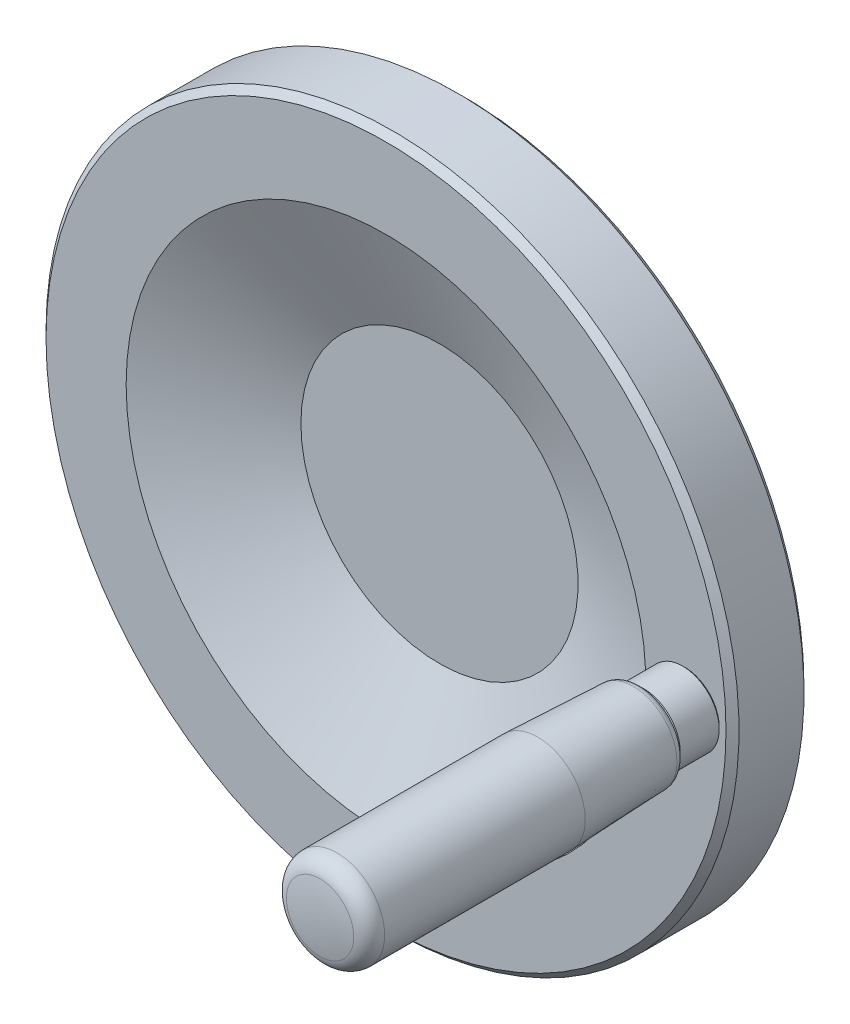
ISO-10303-21;
HEADER;
FILE_DESCRIPTION(('STEP AP214'),'2;1');
FILE_NAME('part.step','',(''),(''),'','','');
FILE_SCHEMA(('AUTOMOTIVE_DESIGN { 1 0 10303 214 1 1 1 1 }'));
ENDSEC;
DATA;
#1=APPLICATION_CONTEXT('core data for automotive mechanical design processes');
#2=APPLICATION_PROTOCOL_DEFINITION('international standard','automotive_design',2000,#1);
#3=PRODUCT_CONTEXT('',#1,'mechanical');
#4=PRODUCT('Part','Part','',(#3));
#5=PRODUCT_RELATED_PRODUCT_CATEGORY('part','',(#4));
#6=PRODUCT_DEFINITION_FORMATION('','',#4);
#7=PRODUCT_DEFINITION_CONTEXT('part definition',#1,'design');
#8=PRODUCT_DEFINITION('design','',#6,#7);
#9=PRODUCT_DEFINITION_SHAPE('','',#8);
#10=(LENGTH_UNIT() NAMED_UNIT(*) SI_UNIT(.MILLI.,.METRE.));
#11=(NAMED_UNIT(*) PLANE_ANGLE_UNIT() SI_UNIT($,.RADIAN.));
#12=(NAMED_UNIT(*) SI_UNIT($,.STERADIAN.) SOLID_ANGLE_UNIT());
#13=UNCERTAINTY_MEASURE_WITH_UNIT(LENGTH_MEASURE(1.E-05),#10,'distance_accuracy_value','');
#14=(GEOMETRIC_REPRESENTATION_CONTEXT(3) GLOBAL_UNCERTAINTY_ASSIGNED_CONTEXT((#13)) GLOBAL_UNIT_ASSIGNED_CONTEXT((#10,
#11,#12)) REPRESENTATION_CONTEXT('',''));
#15=CARTESIAN_POINT('',(0.,0.,0.));
#16=DIRECTION('',(0.,0.,1.));
#17=DIRECTION('',(1.,0.,0.));
#18=AXIS2_PLACEMENT_3D('',#15,#16,#17);
#19=CARTESIAN_POINT('',(0.,0.,50.5));
#20=DIRECTION('',(0.,0.,-1.));
#21=DIRECTION('',(1.,0.,0.));
#22=AXIS2_PLACEMENT_3D('',#19,#20,#21);
#23=CONICAL_SURFACE('',#22,80.,0.785398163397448);
#24=CARTESIAN_POINT('',(0.,0.,52.));
#25=DIRECTION('',(0.,0.,1.));
#26=DIRECTION('',(-1.,0.,0.));
#27=AXIS2_PLACEMENT_3D('',#24,#25,#26);
#28=CIRCLE('',#27,78.5);
#29=CARTESIAN_POINT('',(-78.5000000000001,0.,51.9999999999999));
#30=VERTEX_POINT('',#29);
#31=EDGE_CURVE('E16',#30,#30,#28,.T.);
#32=ORIENTED_EDGE('',*,*,#31,.F.);
#33=EDGE_LOOP('',(#32));
#34=FACE_BOUND('',#33,.T.);
#35=CARTESIAN_POINT('',(0.,0.,50.5));
#36=DIRECTION('',(0.,0.,1.));
#37=DIRECTION('',(-1.,0.,0.));
#38=AXIS2_PLACEMENT_3D('',#35,#36,#37);
#39=CIRCLE('',#38,80.);
#40=CARTESIAN_POINT('',(-80.0000000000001,0.,50.4999999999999));
#41=VERTEX_POINT('',#40);
#42=EDGE_CURVE('E32',#41,#41,#39,.T.);
#43=ORIENTED_EDGE('',*,*,#42,.T.);
#44=EDGE_LOOP('',(#43));
#45=FACE_BOUND('',#44,.T.);
#46=ADVANCED_FACE('F13',(#34,#45),#23,.T.);
#47=CARTESIAN_POINT('',(60.,0.,52.));
#48=DIRECTION('',(0.,0.,1.));
#49=DIRECTION('',(-1.,0.,0.));
#50=AXIS2_PLACEMENT_3D('',#47,#48,#49);
#51=PLANE('',#50);
#52=CARTESIAN_POINT('',(69.,0.,52.));
#53=DIRECTION('',(0.,0.,1.));
#54=DIRECTION('',(0.,-1.,0.));
#55=AXIS2_PLACEMENT_3D('',#52,#53,#54);
#56=CIRCLE('',#55,7.92520452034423);
#57=CARTESIAN_POINT('',(69.,-7.92520452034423,52.));
#58=VERTEX_POINT('',#57);
#59=EDGE_CURVE('E8',#58,#58,#56,.T.);
#60=ORIENTED_EDGE('',*,*,#59,.F.);
#61=EDGE_LOOP('',(#60));
#62=FACE_BOUND('',#61,.T.);
#63=ORIENTED_EDGE('',*,*,#31,.T.);
#64=EDGE_LOOP('',(#63));
#65=FACE_BOUND('',#64,.T.);
#66=CARTESIAN_POINT('',(0.,0.,52.));
#67=DIRECTION('',(0.,0.,1.));
#68=DIRECTION('',(-1.,0.,0.));
#69=AXIS2_PLACEMENT_3D('',#66,#67,#68);
#70=CIRCLE('',#69,60.);
#71=CARTESIAN_POINT('',(-60.0000000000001,0.,52.));
#72=VERTEX_POINT('',#71);
#73=EDGE_CURVE('E27',#72,#72,#70,.T.);
#74=ORIENTED_EDGE('',*,*,#73,.F.);
#75=EDGE_LOOP('',(#74));
#76=FACE_BOUND('',#75,.T.);
#77=ADVANCED_FACE('F82',(#62,#65,#76),#51,.T.);
#78=CARTESIAN_POINT('',(0.,0.,39.6561679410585));
#79=DIRECTION('',(0.,0.,1.));
#80=DIRECTION('',(-1.,0.,0.));
#81=AXIS2_PLACEMENT_3D('',#78,#79,#80);
#82=CONICAL_SURFACE('',#81,32.,1.15557658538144);
#83=ORIENTED_EDGE('',*,*,#73,.T.);
#84=EDGE_LOOP('',(#83));
#85=FACE_BOUND('',#84,.T.);
#86=CARTESIAN_POINT('',(0.,0.,39.6561679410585));
#87=DIRECTION('',(0.,0.,1.));
#88=DIRECTION('',(-1.,0.,0.));
#89=AXIS2_PLACEMENT_3D('',#86,#87,#88);
#90=CIRCLE('',#89,32.);
#91=CARTESIAN_POINT('',(-32.0000000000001,0.,39.6561679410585));
#92=VERTEX_POINT('',#91);
#93=EDGE_CURVE('E72',#92,#92,#90,.T.);
#94=ORIENTED_EDGE('',*,*,#93,.F.);
#95=EDGE_LOOP('',(#94));
#96=FACE_BOUND('',#95,.T.);
#97=ADVANCED_FACE('F79',(#85,#96),#82,.F.);
#98=CARTESIAN_POINT('',(0.,0.,39.6561679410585));
#99=DIRECTION('',(0.,0.,1.));
#100=DIRECTION('',(-1.,0.,0.));
#101=AXIS2_PLACEMENT_3D('',#98,#99,#100);
#102=PLANE('',#101);
#103=ORIENTED_EDGE('',*,*,#93,.T.);
#104=EDGE_LOOP('',(#103));
#105=FACE_BOUND('',#104,.T.);
#106=ADVANCED_FACE('F91',(#105),#102,.T.);
#107=CARTESIAN_POINT('',(16.,0.,0.));
#108=DIRECTION('',(0.,0.,-1.));
#109=DIRECTION('',(1.,0.,0.));
#110=AXIS2_PLACEMENT_3D('',#107,#108,#109);
#111=PLANE('',#110);
#112=CARTESIAN_POINT('',(0.,0.,0.));
#113=DIRECTION('',(0.,0.,1.));
#114=DIRECTION('',(-1.,0.,0.));
#115=AXIS2_PLACEMENT_3D('',#112,#113,#114);
#116=CIRCLE('',#115,16.);
#117=CARTESIAN_POINT('',(-16.0000000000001,0.,0.));
#118=VERTEX_POINT('',#117);
#119=EDGE_CURVE('E68',#118,#118,#116,.T.);
#120=ORIENTED_EDGE('',*,*,#119,.F.);
#121=EDGE_LOOP('',(#120));
#122=FACE_BOUND('',#121,.T.);
#123=ADVANCED_FACE('F98',(#122),#111,.T.);
#124=CARTESIAN_POINT('',(0.,0.,0.));
#125=DIRECTION('',(0.,0.,1.));
#126=DIRECTION('',(-1.,0.,0.));
#127=AXIS2_PLACEMENT_3D('',#124,#125,#126);
#128=CONICAL_SURFACE('',#127,16.,0.785398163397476);
#129=CARTESIAN_POINT('',(0.,0.,1.));
#130=DIRECTION('',(0.,0.,1.));
#131=DIRECTION('',(-1.,0.,0.));
#132=AXIS2_PLACEMENT_3D('',#129,#130,#131);
#133=CIRCLE('',#132,17.);
#134=CARTESIAN_POINT('',(-17.0000000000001,0.,0.999999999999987));
#135=VERTEX_POINT('',#134);
#136=EDGE_CURVE('E64',#135,#135,#133,.T.);
#137=ORIENTED_EDGE('',*,*,#136,.F.);
#138=EDGE_LOOP('',(#137));
#139=FACE_BOUND('',#138,.T.);
#140=ORIENTED_EDGE('',*,*,#119,.T.);
#141=EDGE_LOOP('',(#140));
#142=FACE_BOUND('',#141,.T.);
#143=ADVANCED_FACE('F102',(#139,#142),#128,.T.);
#144=CARTESIAN_POINT('',(0.,0.,62.));
#145=DIRECTION('',(0.,0.,1.));
#146=DIRECTION('',(-1.,0.,0.));
#147=AXIS2_PLACEMENT_3D('',#144,#145,#146);
#148=CYLINDRICAL_SURFACE('',#147,17.);
#149=ORIENTED_EDGE('',*,*,#136,.T.);
#150=EDGE_LOOP('',(#149));
#151=FACE_BOUND('',#150,.T.);
#152=CARTESIAN_POINT('',(0.,0.,16.));
#153=DIRECTION('',(0.,0.,1.));
#154=DIRECTION('',(-1.,0.,0.));
#155=AXIS2_PLACEMENT_3D('',#152,#153,#154);
#156=CIRCLE('',#155,17.);
#157=CARTESIAN_POINT('',(-17.0000000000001,0.,16.));
#158=VERTEX_POINT('',#157);
#159=EDGE_CURVE('E60',#158,#158,#156,.T.);
#160=ORIENTED_EDGE('',*,*,#159,.F.);
#161=EDGE_LOOP('',(#160));
#162=FACE_BOUND('',#161,.T.);
#163=ADVANCED_FACE('F106',(#151,#162),#148,.T.);
#164=CARTESIAN_POINT('',(21.5,0.,16.));
#165=DIRECTION('',(0.,0.,-1.));
#166=DIRECTION('',(1.,0.,0.));
#167=AXIS2_PLACEMENT_3D('',#164,#165,#166);
#168=PLANE('',#167);
#169=ORIENTED_EDGE('',*,*,#159,.T.);
#170=EDGE_LOOP('',(#169));
#171=FACE_BOUND('',#170,.T.);
#172=CARTESIAN_POINT('',(0.,0.,16.));
#173=DIRECTION('',(0.,0.,1.));
#174=DIRECTION('',(-1.,0.,0.));
#175=AXIS2_PLACEMENT_3D('',#172,#173,#174);
#176=CIRCLE('',#175,21.5);
#177=CARTESIAN_POINT('',(-21.5000000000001,0.,16.));
#178=VERTEX_POINT('',#177);
#179=EDGE_CURVE('E56',#178,#178,#176,.T.);
#180=ORIENTED_EDGE('',*,*,#179,.F.);
#181=EDGE_LOOP('',(#180));
#182=FACE_BOUND('',#181,.T.);
#183=ADVANCED_FACE('F110',(#171,#182),#168,.T.);
#184=CARTESIAN_POINT('',(0.,0.,62.));
#185=DIRECTION('',(0.,0.,1.));
#186=DIRECTION('',(-1.,0.,0.));
#187=AXIS2_PLACEMENT_3D('',#184,#185,#186);
#188=CYLINDRICAL_SURFACE('',#187,21.5);
#189=CARTESIAN_POINT('',(0.,0.,20.848797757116));
#190=DIRECTION('',(0.,0.,1.));
#191=DIRECTION('',(-1.,0.,0.));
#192=AXIS2_PLACEMENT_3D('',#189,#190,#191);
#193=CIRCLE('',#192,21.5);
#194=CARTESIAN_POINT('',(-21.5000000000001,0.,20.848797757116));
#195=VERTEX_POINT('',#194);
#196=EDGE_CURVE('E52',#195,#195,#193,.T.);
#197=ORIENTED_EDGE('',*,*,#196,.F.);
#198=EDGE_LOOP('',(#197));
#199=FACE_BOUND('',#198,.T.);
#200=ORIENTED_EDGE('',*,*,#179,.T.);
#201=EDGE_LOOP('',(#200));
#202=FACE_BOUND('',#201,.T.);
#203=ADVANCED_FACE('F114',(#199,#202),#188,.T.);
#204=CARTESIAN_POINT('',(0.,0.,20.848797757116));
#205=DIRECTION('',(0.,0.,1.));
#206=DIRECTION('',(-1.,0.,0.));
#207=AXIS2_PLACEMENT_3D('',#204,#205,#206);
#208=TOROIDAL_SURFACE('',#207,26.5,5.);
#209=ORIENTED_EDGE('',*,*,#196,.T.);
#210=EDGE_LOOP('',(#209));
#211=FACE_BOUND('',#210,.T.);
#212=CARTESIAN_POINT('',(0.,0.,25.2848817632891));
#213=DIRECTION('',(0.,0.,1.));
#214=DIRECTION('',(-1.,0.,0.));
#215=AXIS2_PLACEMENT_3D('',#212,#213,#214);
#216=CIRCLE('',#215,24.1932363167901);
#217=CARTESIAN_POINT('',(-24.1932363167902,0.,25.284881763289));
#218=VERTEX_POINT('',#217);
#219=EDGE_CURVE('E48',#218,#218,#216,.T.);
#220=ORIENTED_EDGE('',*,*,#219,.F.);
#221=EDGE_LOOP('',(#220));
#222=FACE_BOUND('',#221,.T.);
#223=ADVANCED_FACE('F118',(#211,#222),#208,.F.);
#224=CARTESIAN_POINT('',(0.,0.,25.2848817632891));
#225=DIRECTION('',(0.,0.,1.));
#226=DIRECTION('',(-1.,0.,0.));
#227=AXIS2_PLACEMENT_3D('',#224,#225,#226);
#228=CONICAL_SURFACE('',#227,24.1932363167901,1.09127703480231);
#229=CARTESIAN_POINT('',(0.,0.,34.));
#230=DIRECTION('',(0.,0.,1.));
#231=DIRECTION('',(-1.,0.,0.));
#232=AXIS2_PLACEMENT_3D('',#229,#230,#231);
#233=CIRCLE('',#232,40.9530790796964);
#234=CARTESIAN_POINT('',(-40.9530790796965,0.,34.));
#235=VERTEX_POINT('',#234);
#236=EDGE_CURVE('E44',#235,#235,#233,.T.);
#237=ORIENTED_EDGE('',*,*,#236,.F.);
#238=EDGE_LOOP('',(#237));
#239=FACE_BOUND('',#238,.T.);
#240=ORIENTED_EDGE('',*,*,#219,.T.);
#241=EDGE_LOOP('',(#240));
#242=FACE_BOUND('',#241,.T.);
#243=ADVANCED_FACE('F122',(#239,#242),#228,.T.);
#244=CARTESIAN_POINT('',(40.9530790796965,0.,34.));
#245=DIRECTION('',(0.,0.,1.));
#246=DIRECTION('',(-1.,0.,0.));
#247=AXIS2_PLACEMENT_3D('',#244,#245,#246);
#248=PLANE('',#247);
#249=CARTESIAN_POINT('',(0.,0.,34.));
#250=DIRECTION('',(0.,0.,1.));
#251=DIRECTION('',(-1.,0.,0.));
#252=AXIS2_PLACEMENT_3D('',#249,#250,#251);
#253=CIRCLE('',#252,78.5);
#254=CARTESIAN_POINT('',(-78.5000000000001,0.,33.9999999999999));
#255=VERTEX_POINT('',#254);
#256=EDGE_CURVE('E40',#255,#255,#253,.T.);
#257=ORIENTED_EDGE('',*,*,#256,.F.);
#258=EDGE_LOOP('',(#257));
#259=FACE_BOUND('',#258,.T.);
#260=ORIENTED_EDGE('',*,*,#236,.T.);
#261=EDGE_LOOP('',(#260));
#262=FACE_BOUND('',#261,.T.);
#263=ADVANCED_FACE('F126',(#259,#262),#248,.F.);
#264=CARTESIAN_POINT('',(0.,0.,35.5));
#265=DIRECTION('',(0.,0.,1.));
#266=DIRECTION('',(-1.,0.,0.));
#267=AXIS2_PLACEMENT_3D('',#264,#265,#266);
#268=CONICAL_SURFACE('',#267,80.,0.785398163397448);
#269=ORIENTED_EDGE('',*,*,#256,.T.);
#270=EDGE_LOOP('',(#269));
#271=FACE_BOUND('',#270,.T.);
#272=CARTESIAN_POINT('',(0.,0.,35.5));
#273=DIRECTION('',(0.,0.,1.));
#274=DIRECTION('',(-1.,0.,0.));
#275=AXIS2_PLACEMENT_3D('',#272,#273,#274);
#276=CIRCLE('',#275,80.);
#277=CARTESIAN_POINT('',(-80.0000000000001,0.,35.4999999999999));
#278=VERTEX_POINT('',#277);
#279=EDGE_CURVE('E36',#278,#278,#276,.T.);
#280=ORIENTED_EDGE('',*,*,#279,.F.);
#281=EDGE_LOOP('',(#280));
#282=FACE_BOUND('',#281,.T.);
#283=ADVANCED_FACE('F130',(#271,#282),#268,.T.);
#284=CARTESIAN_POINT('',(0.,0.,62.));
#285=DIRECTION('',(0.,0.,1.));
#286=DIRECTION('',(-1.,0.,0.));
#287=AXIS2_PLACEMENT_3D('',#284,#285,#286);
#288=CYLINDRICAL_SURFACE('',#287,80.);
#289=ORIENTED_EDGE('',*,*,#279,.T.);
#290=EDGE_LOOP('',(#289));
#291=FACE_BOUND('',#290,.T.);
#292=ORIENTED_EDGE('',*,*,#42,.F.);
#293=EDGE_LOOP('',(#292));
#294=FACE_BOUND('',#293,.T.);
#295=ADVANCED_FACE('F134',(#291,#294),#288,.T.);
#296=CARTESIAN_POINT('',(69.,0.,97.));
#297=DIRECTION('',(0.,-1.,0.));
#298=DIRECTION('',(0.,0.,-1.));
#299=AXIS2_PLACEMENT_3D('',#296,#297,#298);
#300=SPHERICAL_SURFACE('',#299,40.);
#301=CARTESIAN_POINT('',(69.,0.,97.));
#302=DIRECTION('',(0.,0.,1.));
#303=DIRECTION('',(0.,-1.,0.));
#304=AXIS2_PLACEMENT_3D('',#301,#302,#303);
#305=SPHERICAL_SURFACE('',#304,40.);
#306=CARTESIAN_POINT('',(69.,0.,136.236541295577));
#307=DIRECTION('',(0.,0.,1.));
#308=DIRECTION('',(0.,-1.,0.));
#309=AXIS2_PLACEMENT_3D('',#306,#307,#308);
#310=CIRCLE('',#309,7.77777777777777);
#311=CARTESIAN_POINT('',(69.,-7.77777777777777,136.236541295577));
#312=VERTEX_POINT('',#311);
#313=EDGE_CURVE('E179',#312,#312,#310,.T.);
#314=ORIENTED_EDGE('',*,*,#313,.T.);
#315=EDGE_LOOP('',(#314));
#316=FACE_BOUND('',#315,.T.);
#317=ADVANCED_FACE('F138',(#316),#305,.T.);
#318=CARTESIAN_POINT('',(69.,0.,52.5));
#319=DIRECTION('',(0.,0.,1.));
#320=DIRECTION('',(0.,-1.,0.));
#321=AXIS2_PLACEMENT_3D('',#318,#319,#320);
#322=CONICAL_SURFACE('',#321,8.42520452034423,0.785398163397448);
#323=ORIENTED_EDGE('',*,*,#59,.T.);
#324=EDGE_LOOP('',(#323));
#325=FACE_BOUND('',#324,.T.);
#326=CARTESIAN_POINT('',(69.,0.,52.5));
#327=DIRECTION('',(0.,0.,1.));
#328=DIRECTION('',(0.,-1.,0.));
#329=AXIS2_PLACEMENT_3D('',#326,#327,#328);
#330=CIRCLE('',#329,8.42520452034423);
#331=CARTESIAN_POINT('',(69.,-8.42520452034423,52.5));
#332=VERTEX_POINT('',#331);
#333=EDGE_CURVE('E30',#332,#332,#330,.T.);
#334=ORIENTED_EDGE('',*,*,#333,.F.);
#335=EDGE_LOOP('',(#334));
#336=FACE_BOUND('',#335,.T.);
#337=ADVANCED_FACE('F142',(#325,#336),#322,.T.);
#338=CARTESIAN_POINT('',(69.,0.,147.));
#339=DIRECTION('',(0.,0.,1.));
#340=DIRECTION('',(0.,-1.,0.));
#341=AXIS2_PLACEMENT_3D('',#338,#339,#340);
#342=CYLINDRICAL_SURFACE('',#341,8.42520452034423);
#343=CARTESIAN_POINT('',(69.,0.,61.5));
#344=DIRECTION('',(0.,0.,1.));
#345=DIRECTION('',(0.,-1.,0.));
#346=AXIS2_PLACEMENT_3D('',#343,#344,#345);
#347=CIRCLE('',#346,8.42520452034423);
#348=CARTESIAN_POINT('',(69.,-8.42520452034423,61.5));
#349=VERTEX_POINT('',#348);
#350=EDGE_CURVE('E204',#349,#349,#347,.T.);
#351=ORIENTED_EDGE('',*,*,#350,.F.);
#352=EDGE_LOOP('',(#351));
#353=FACE_BOUND('',#352,.T.);
#354=ORIENTED_EDGE('',*,*,#333,.T.);
#355=EDGE_LOOP('',(#354));
#356=FACE_BOUND('',#355,.T.);
#357=ADVANCED_FACE('F146',(#353,#356),#342,.T.);
#358=CARTESIAN_POINT('',(69.,0.,61.5));
#359=DIRECTION('',(0.,0.,-1.));
#360=DIRECTION('',(0.,1.,0.));
#361=AXIS2_PLACEMENT_3D('',#358,#359,#360);
#362=CONICAL_SURFACE('',#361,8.42520452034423,0.785398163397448);
#363=CARTESIAN_POINT('',(69.,0.,62.));
#364=DIRECTION('',(0.,0.,1.));
#365=DIRECTION('',(0.,-1.,0.));
#366=AXIS2_PLACEMENT_3D('',#363,#364,#365);
#367=CIRCLE('',#366,7.92520452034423);
#368=CARTESIAN_POINT('',(69.,-7.92520452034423,62.));
#369=VERTEX_POINT('',#368);
#370=EDGE_CURVE('E201',#369,#369,#367,.T.);
#371=ORIENTED_EDGE('',*,*,#370,.F.);
#372=EDGE_LOOP('',(#371));
#373=FACE_BOUND('',#372,.T.);
#374=ORIENTED_EDGE('',*,*,#350,.T.);
#375=EDGE_LOOP('',(#374));
#376=FACE_BOUND('',#375,.T.);
#377=ADVANCED_FACE('F149',(#373,#376),#362,.T.);
#378=CARTESIAN_POINT('',(77.081597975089,0.,62.));
#379=DIRECTION('',(0.,0.,-1.));
#380=DIRECTION('',(0.,1.,0.));
#381=AXIS2_PLACEMENT_3D('',#378,#379,#380);
#382=PLANE('',#381);
#383=ORIENTED_EDGE('',*,*,#370,.T.);
#384=EDGE_LOOP('',(#383));
#385=FACE_BOUND('',#384,.T.);
#386=CARTESIAN_POINT('',(69.,0.,62.));
#387=DIRECTION('',(0.,0.,1.));
#388=DIRECTION('',(0.,-1.,0.));
#389=AXIS2_PLACEMENT_3D('',#386,#387,#388);
#390=CIRCLE('',#389,8.08159797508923);
#391=CARTESIAN_POINT('',(69.,-8.08159797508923,62.));
#392=VERTEX_POINT('',#391);
#393=EDGE_CURVE('E197',#392,#392,#390,.T.);
#394=ORIENTED_EDGE('',*,*,#393,.F.);
#395=EDGE_LOOP('',(#394));
#396=FACE_BOUND('',#395,.T.);
#397=ADVANCED_FACE('F153',(#385,#396),#382,.T.);
#398=CARTESIAN_POINT('',(69.,0.,64.));
#399=DIRECTION('',(0.,0.,1.));
#400=DIRECTION('',(0.,-1.,0.));
#401=AXIS2_PLACEMENT_3D('',#398,#399,#400);
#402=TOROIDAL_SURFACE('',#401,8.08159797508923,1.99999999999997);
#403=CARTESIAN_POINT('',(69.,0.,63.9167389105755));
#404=DIRECTION('',(0.,0.,1.));
#405=DIRECTION('',(0.,-1.,0.));
#406=AXIS2_PLACEMENT_3D('',#403,#404,#405);
#407=CIRCLE('',#406,10.0798641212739);
#408=CARTESIAN_POINT('',(69.,-10.0798641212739,63.9167389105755));
#409=VERTEX_POINT('',#408);
#410=EDGE_CURVE('E190',#409,#409,#407,.T.);
#411=ORIENTED_EDGE('',*,*,#410,.F.);
#412=EDGE_LOOP('',(#411));
#413=FACE_BOUND('',#412,.T.);
#414=ORIENTED_EDGE('',*,*,#393,.T.);
#415=EDGE_LOOP('',(#414));
#416=FACE_BOUND('',#415,.T.);
#417=ADVANCED_FACE('F157',(#413,#416),#402,.T.);
#418=CARTESIAN_POINT('',(69.,0.,86.));
#419=DIRECTION('',(0.,0.,1.));
#420=DIRECTION('',(0.,-1.,0.));
#421=AXIS2_PLACEMENT_3D('',#418,#419,#420);
#422=CONICAL_SURFACE('',#421,11.,0.0416425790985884);
#423=ORIENTED_EDGE('',*,*,#410,.T.);
#424=EDGE_LOOP('',(#423));
#425=FACE_BOUND('',#424,.T.);
#426=CARTESIAN_POINT('',(69.,0.,86.));
#427=DIRECTION('',(0.,0.,1.));
#428=DIRECTION('',(0.,-1.,0.));
#429=AXIS2_PLACEMENT_3D('',#426,#427,#428);
#430=CIRCLE('',#429,11.);
#431=CARTESIAN_POINT('',(69.,-11.,86.));
#432=VERTEX_POINT('',#431);
#433=EDGE_CURVE('E185',#432,#432,#430,.T.);
#434=ORIENTED_EDGE('',*,*,#433,.F.);
#435=EDGE_LOOP('',(#434));
#436=FACE_BOUND('',#435,.T.);
#437=ADVANCED_FACE('F161',(#425,#436),#422,.T.);
#438=CARTESIAN_POINT('',(69.,0.,147.));
#439=DIRECTION('',(0.,0.,1.));
#440=DIRECTION('',(0.,-1.,0.));
#441=AXIS2_PLACEMENT_3D('',#438,#439,#440);
#442=CYLINDRICAL_SURFACE('',#441,11.);
#443=ORIENTED_EDGE('',*,*,#433,.T.);
#444=EDGE_LOOP('',(#443));
#445=FACE_BOUND('',#444,.T.);
#446=CARTESIAN_POINT('',(69.,0.,132.312887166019));
#447=DIRECTION('',(0.,0.,1.));
#448=DIRECTION('',(0.,-1.,0.));
#449=AXIS2_PLACEMENT_3D('',#446,#447,#448);
#450=CIRCLE('',#449,11.);
#451=CARTESIAN_POINT('',(69.,-11.,132.312887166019));
#452=VERTEX_POINT('',#451);
#453=EDGE_CURVE('E182',#452,#452,#450,.T.);
#454=ORIENTED_EDGE('',*,*,#453,.F.);
#455=EDGE_LOOP('',(#454));
#456=FACE_BOUND('',#455,.T.);
#457=ADVANCED_FACE('F165',(#445,#456),#442,.T.);
#458=CARTESIAN_POINT('',(69.,0.,132.312887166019));
#459=DIRECTION('',(0.,0.,1.));
#460=DIRECTION('',(0.,-1.,0.));
#461=AXIS2_PLACEMENT_3D('',#458,#459,#460);
#462=TOROIDAL_SURFACE('',#461,7.,3.99999999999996);
#463=ORIENTED_EDGE('',*,*,#313,.F.);
#464=EDGE_LOOP('',(#463));
#465=FACE_BOUND('',#464,.T.);
#466=ORIENTED_EDGE('',*,*,#453,.T.);
#467=EDGE_LOOP('',(#466));
#468=FACE_BOUND('',#467,.T.);
#469=ADVANCED_FACE('F169',(#465,#468),#462,.T.);
#470=CLOSED_SHELL('',(#46,#77,#97,#106,#123,#143,#163,#183,#203,#223,#243,#263,#283,#295,#317,
#337,#357,#377,#397,#417,#437,#457,#469));
#471=MANIFOLD_SOLID_BREP('B1',#470);
#472=ADVANCED_BREP_SHAPE_REPRESENTATION('',(#18,#471),#14);
#473=SHAPE_DEFINITION_REPRESENTATION(#9,#472);
ENDSEC;
END-ISO-10303-21;
